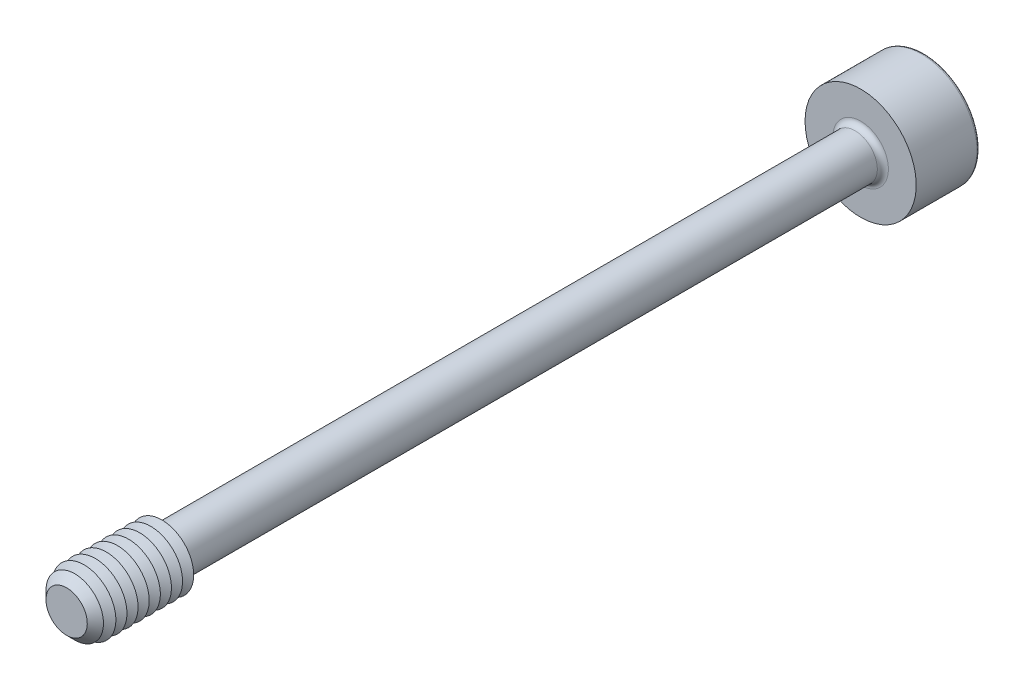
from build123d import *

# Parameters (mm, degrees)
SKETCH1_R       = 1.4
EXTRUDE1_DEPTH  = 25
CHAMFER1_SIZE   = 0.7
SKETCH3_R       = 3.5
EXTRUDE2_DEPTH  = 4
EXTRUDE3_DEPTH  = 3
FILLET1_R       = 0.35
FILLET2_R       = 0.175
LPATTERN1_COUNT = 8
LPATTERN1_PITCH = 0.7


with BuildPart() as part:
    # Sketch1 → Extrude1 (new, symmetric)
    with BuildSketch(Plane.XY):
        Circle(SKETCH1_R)
    extrude(amount=EXTRUDE1_DEPTH, both=True)

    # Sketch2 → Revolve1 (revolve)
    with BuildSketch(Plane(origin=(0, 0, 0), x_dir=(0, 0, -1), z_dir=(1, 0, 0))):
        Polygon((-25, 0), (-25, 2), (-19, 2), (-18.653589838, 1.4), (-18.653589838, 0), align=None)
    revolve(axis=Axis((0, 0, 18.653589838), (0, 0, 1)))

    # Chamfer1
    chamfer1_edges = [part.edges().sort_by_distance(p)[0] for p in [
        (0, -2, 25),
    ]]
    chamfer(chamfer1_edges, length=CHAMFER1_SIZE)

    # Sketch3 → Extrude2 (add)
    with BuildSketch(Plane(origin=(0, 0, -25), x_dir=(-1, 0, 0), z_dir=(0, 0, -1))):
        Circle(SKETCH3_R)
    extrude(amount=EXTRUDE2_DEPTH)

    # Sketch4 → Extrude3 (cut)
    with BuildSketch(Plane(origin=(-13.7, 0, -29), x_dir=(1, 0, 0), z_dir=(0, 0, 1))):
        Polygon((12.833974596, -1.5), (14.566025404, -1.5), (15.432050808, 0), (14.566025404, 1.5), (12.833974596, 1.5), (11.967949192, 0), align=None)
    extrude(amount=EXTRUDE3_DEPTH, mode=Mode.SUBTRACT)

    # Fillet1
    fillet1_edges = [part.edges().sort_by_distance(p)[0] for p in [
        (-1.4, 0, -25),
    ]]
    fillet(fillet1_edges, radius=FILLET1_R)

    # Fillet2
    fillet2_edges = [part.edges().sort_by_distance(p)[0] for p in [
        (3.5, 0, -29),
    ]]
    fillet(fillet2_edges, radius=FILLET2_R)

    # Sketch5 → Cut-Revolve1 (revolve, cut)
    with BuildSketch(Plane(origin=(0, 0, 0), x_dir=(0, 0, -1), z_dir=(1, 0, 0)), mode=Mode.PRIVATE) as cut_revolve1_sk:
        Polygon((26, 0), (26, -1.5), (25.133974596, 0), align=None)
    revolve(cut_revolve1_sk.sketch.rotate(Axis((0, 0, -25.133974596), (0, 0, -1)), 90), axis=Axis((0, 0, -25.133974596), (0, 0, -1)), mode=Mode.SUBTRACT)

    # Sketch7 → Cut-Revolve2 (revolve, cut)
    with BuildSketch(Plane(origin=(0, 0, 0), x_dir=(0, 0, -1), z_dir=(1, 0, 0)), mode=Mode.PRIVATE) as cut_revolve2_sk:
        Polygon((-19, 2), (-19.35, 1.393782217), (-19.7, 2), align=None)
    cut_revolve2 = revolve(cut_revolve2_sk.sketch.rotate(Axis((0, 0, -1.332048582), (0, 0, 1)), 90), axis=Axis((0, 0, -1.332048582), (0, 0, 1)), mode=Mode.SUBTRACT)

    # LPattern1: Cut-Revolve2 ×8
    with Locations(*[(0, 0, i * LPATTERN1_PITCH) for i in range(1, LPATTERN1_COUNT)]):
        add(cut_revolve2, mode=Mode.SUBTRACT)


solid = part.part
